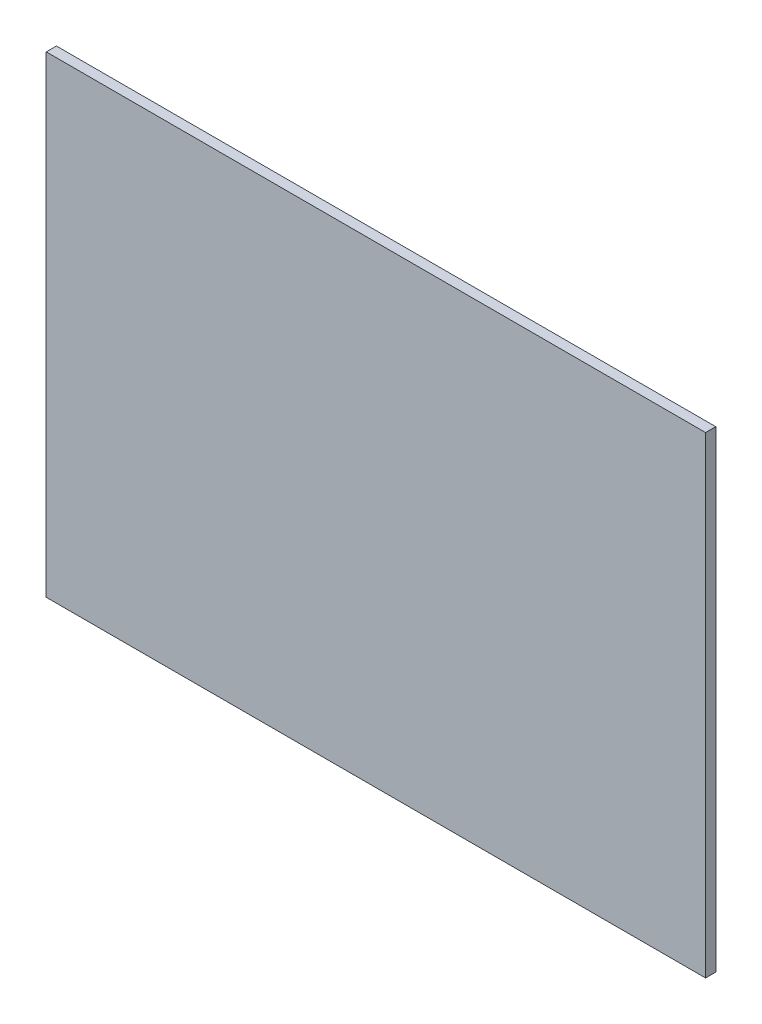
ISO-10303-21;
HEADER;
FILE_DESCRIPTION(('STEP AP214'),'2;1');
FILE_NAME('part.step','',(''),(''),'','','');
FILE_SCHEMA(('AUTOMOTIVE_DESIGN { 1 0 10303 214 1 1 1 1 }'));
ENDSEC;
DATA;
#1=APPLICATION_CONTEXT('core data for automotive mechanical design processes');
#2=APPLICATION_PROTOCOL_DEFINITION('international standard','automotive_design',2000,#1);
#3=PRODUCT_CONTEXT('',#1,'mechanical');
#4=PRODUCT('Part','Part','',(#3));
#5=PRODUCT_RELATED_PRODUCT_CATEGORY('part','',(#4));
#6=PRODUCT_DEFINITION_FORMATION('','',#4);
#7=PRODUCT_DEFINITION_CONTEXT('part definition',#1,'design');
#8=PRODUCT_DEFINITION('design','',#6,#7);
#9=PRODUCT_DEFINITION_SHAPE('','',#8);
#10=(LENGTH_UNIT() NAMED_UNIT(*) SI_UNIT(.MILLI.,.METRE.));
#11=(NAMED_UNIT(*) PLANE_ANGLE_UNIT() SI_UNIT($,.RADIAN.));
#12=(NAMED_UNIT(*) SI_UNIT($,.STERADIAN.) SOLID_ANGLE_UNIT());
#13=UNCERTAINTY_MEASURE_WITH_UNIT(LENGTH_MEASURE(1.E-05),#10,'distance_accuracy_value','');
#14=(GEOMETRIC_REPRESENTATION_CONTEXT(3) GLOBAL_UNCERTAINTY_ASSIGNED_CONTEXT((#13)) GLOBAL_UNIT_ASSIGNED_CONTEXT((#10,
#11,#12)) REPRESENTATION_CONTEXT('',''));
#15=CARTESIAN_POINT('',(0.,0.,0.));
#16=DIRECTION('',(0.,0.,1.));
#17=DIRECTION('',(1.,0.,0.));
#18=AXIS2_PLACEMENT_3D('',#15,#16,#17);
#19=CARTESIAN_POINT('',(0.,0.,-2.));
#20=DIRECTION('',(-1.,0.,0.));
#21=DIRECTION('',(0.,0.,1.));
#22=AXIS2_PLACEMENT_3D('',#19,#20,#21);
#23=PLANE('',#22);
#24=DIRECTION('',(0.,-1.,0.));
#25=VECTOR('',#24,1.);
#26=CARTESIAN_POINT('',(0.,0.,0.));
#27=LINE('',#26,#25);
#28=CARTESIAN_POINT('',(0.,92.9473944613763,0.));
#29=VERTEX_POINT('',#28);
#30=CARTESIAN_POINT('',(0.,0.,0.));
#31=VERTEX_POINT('',#30);
#32=EDGE_CURVE('E98',#29,#31,#27,.T.);
#33=ORIENTED_EDGE('',*,*,#32,.F.);
#34=DIRECTION('',(0.,0.,1.));
#35=VECTOR('',#34,1.);
#36=CARTESIAN_POINT('',(0.,92.9473944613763,-2.));
#37=LINE('',#36,#35);
#38=CARTESIAN_POINT('',(0.,92.9473944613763,-2.));
#39=VERTEX_POINT('',#38);
#40=EDGE_CURVE('E11',#39,#29,#37,.T.);
#41=ORIENTED_EDGE('',*,*,#40,.F.);
#42=DIRECTION('',(0.,-1.,0.));
#43=VECTOR('',#42,1.);
#44=CARTESIAN_POINT('',(0.,0.,-2.));
#45=LINE('',#44,#43);
#46=CARTESIAN_POINT('',(0.,0.,-2.));
#47=VERTEX_POINT('',#46);
#48=EDGE_CURVE('E92',#39,#47,#45,.T.);
#49=ORIENTED_EDGE('',*,*,#48,.T.);
#50=DIRECTION('',(0.,0.,1.));
#51=VECTOR('',#50,1.);
#52=CARTESIAN_POINT('',(0.,0.,-2.));
#53=LINE('',#52,#51);
#54=EDGE_CURVE('E37',#47,#31,#53,.T.);
#55=ORIENTED_EDGE('',*,*,#54,.T.);
#56=EDGE_LOOP('',(#33,#41,#49,#55));
#57=FACE_BOUND('',#56,.T.);
#58=ADVANCED_FACE('F34',(#57),#23,.T.);
#59=CARTESIAN_POINT('',(0.,92.9473944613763,-2.));
#60=DIRECTION('',(0.,1.,0.));
#61=DIRECTION('',(0.,0.,1.));
#62=AXIS2_PLACEMENT_3D('',#59,#60,#61);
#63=PLANE('',#62);
#64=DIRECTION('',(-1.,0.,0.));
#65=VECTOR('',#64,1.);
#66=CARTESIAN_POINT('',(0.,92.9473944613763,0.));
#67=LINE('',#66,#65);
#68=CARTESIAN_POINT('',(129.744833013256,92.9473944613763,0.));
#69=VERTEX_POINT('',#68);
#70=EDGE_CURVE('E94',#69,#29,#67,.T.);
#71=ORIENTED_EDGE('',*,*,#70,.F.);
#72=DIRECTION('',(0.,0.,1.));
#73=VECTOR('',#72,1.);
#74=CARTESIAN_POINT('',(129.744833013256,92.9473944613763,-2.));
#75=LINE('',#74,#73);
#76=CARTESIAN_POINT('',(129.744833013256,92.9473944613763,-2.));
#77=VERTEX_POINT('',#76);
#78=EDGE_CURVE('E43',#77,#69,#75,.T.);
#79=ORIENTED_EDGE('',*,*,#78,.F.);
#80=DIRECTION('',(-1.,0.,0.));
#81=VECTOR('',#80,1.);
#82=CARTESIAN_POINT('',(0.,92.9473944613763,-2.));
#83=LINE('',#82,#81);
#84=EDGE_CURVE('E89',#77,#39,#83,.T.);
#85=ORIENTED_EDGE('',*,*,#84,.T.);
#86=ORIENTED_EDGE('',*,*,#40,.T.);
#87=EDGE_LOOP('',(#71,#79,#85,#86));
#88=FACE_BOUND('',#87,.T.);
#89=ADVANCED_FACE('F108',(#88),#63,.T.);
#90=CARTESIAN_POINT('',(129.744833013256,0.,-2.));
#91=DIRECTION('',(1.,0.,0.));
#92=DIRECTION('',(0.,0.,-1.));
#93=AXIS2_PLACEMENT_3D('',#90,#91,#92);
#94=PLANE('',#93);
#95=DIRECTION('',(0.,1.,0.));
#96=VECTOR('',#95,1.);
#97=CARTESIAN_POINT('',(129.744833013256,0.,0.));
#98=LINE('',#97,#96);
#99=CARTESIAN_POINT('',(129.744833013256,0.,0.));
#100=VERTEX_POINT('',#99);
#101=EDGE_CURVE('E84',#100,#69,#98,.T.);
#102=ORIENTED_EDGE('',*,*,#101,.F.);
#103=DIRECTION('',(0.,0.,1.));
#104=VECTOR('',#103,1.);
#105=CARTESIAN_POINT('',(129.744833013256,0.,-2.));
#106=LINE('',#105,#104);
#107=CARTESIAN_POINT('',(129.744833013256,0.,-2.));
#108=VERTEX_POINT('',#107);
#109=EDGE_CURVE('E79',#108,#100,#106,.T.);
#110=ORIENTED_EDGE('',*,*,#109,.F.);
#111=DIRECTION('',(0.,1.,0.));
#112=VECTOR('',#111,1.);
#113=CARTESIAN_POINT('',(129.744833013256,0.,-2.));
#114=LINE('',#113,#112);
#115=EDGE_CURVE('E82',#108,#77,#114,.T.);
#116=ORIENTED_EDGE('',*,*,#115,.T.);
#117=ORIENTED_EDGE('',*,*,#78,.T.);
#118=EDGE_LOOP('',(#102,#110,#116,#117));
#119=FACE_BOUND('',#118,.T.);
#120=ADVANCED_FACE('F81',(#119),#94,.T.);
#121=CARTESIAN_POINT('',(0.,0.,-2.));
#122=DIRECTION('',(0.,-1.,0.));
#123=DIRECTION('',(0.,0.,-1.));
#124=AXIS2_PLACEMENT_3D('',#121,#122,#123);
#125=PLANE('',#124);
#126=DIRECTION('',(1.,0.,0.));
#127=VECTOR('',#126,1.);
#128=CARTESIAN_POINT('',(0.,0.,0.));
#129=LINE('',#128,#127);
#130=EDGE_CURVE('E101',#31,#100,#129,.T.);
#131=ORIENTED_EDGE('',*,*,#130,.F.);
#132=ORIENTED_EDGE('',*,*,#54,.F.);
#133=DIRECTION('',(1.,0.,0.));
#134=VECTOR('',#133,1.);
#135=CARTESIAN_POINT('',(0.,0.,-2.));
#136=LINE('',#135,#134);
#137=EDGE_CURVE('E88',#47,#108,#136,.T.);
#138=ORIENTED_EDGE('',*,*,#137,.T.);
#139=ORIENTED_EDGE('',*,*,#109,.T.);
#140=EDGE_LOOP('',(#131,#132,#138,#139));
#141=FACE_BOUND('',#140,.T.);
#142=ADVANCED_FACE('F91',(#141),#125,.T.);
#143=CARTESIAN_POINT('',(0.,92.9473944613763,-2.));
#144=DIRECTION('',(0.,0.,-1.));
#145=DIRECTION('',(-1.,0.,0.));
#146=AXIS2_PLACEMENT_3D('',#143,#144,#145);
#147=PLANE('',#146);
#148=ORIENTED_EDGE('',*,*,#48,.F.);
#149=ORIENTED_EDGE('',*,*,#84,.F.);
#150=ORIENTED_EDGE('',*,*,#115,.F.);
#151=ORIENTED_EDGE('',*,*,#137,.F.);
#152=EDGE_LOOP('',(#148,#149,#150,#151));
#153=FACE_BOUND('',#152,.T.);
#154=ADVANCED_FACE('F87',(#153),#147,.T.);
#155=CARTESIAN_POINT('',(0.,92.9473944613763,0.));
#156=DIRECTION('',(0.,0.,-1.));
#157=DIRECTION('',(-1.,0.,0.));
#158=AXIS2_PLACEMENT_3D('',#155,#156,#157);
#159=PLANE('',#158);
#160=ORIENTED_EDGE('',*,*,#32,.T.);
#161=ORIENTED_EDGE('',*,*,#130,.T.);
#162=ORIENTED_EDGE('',*,*,#101,.T.);
#163=ORIENTED_EDGE('',*,*,#70,.T.);
#164=EDGE_LOOP('',(#160,#161,#162,#163));
#165=FACE_BOUND('',#164,.T.);
#166=ADVANCED_FACE('F107',(#165),#159,.F.);
#167=CLOSED_SHELL('',(#58,#89,#120,#142,#154,#166));
#168=MANIFOLD_SOLID_BREP('B2',#167);
#169=ADVANCED_BREP_SHAPE_REPRESENTATION('',(#18,#168),#14);
#170=SHAPE_DEFINITION_REPRESENTATION(#9,#169);
ENDSEC;
END-ISO-10303-21;
